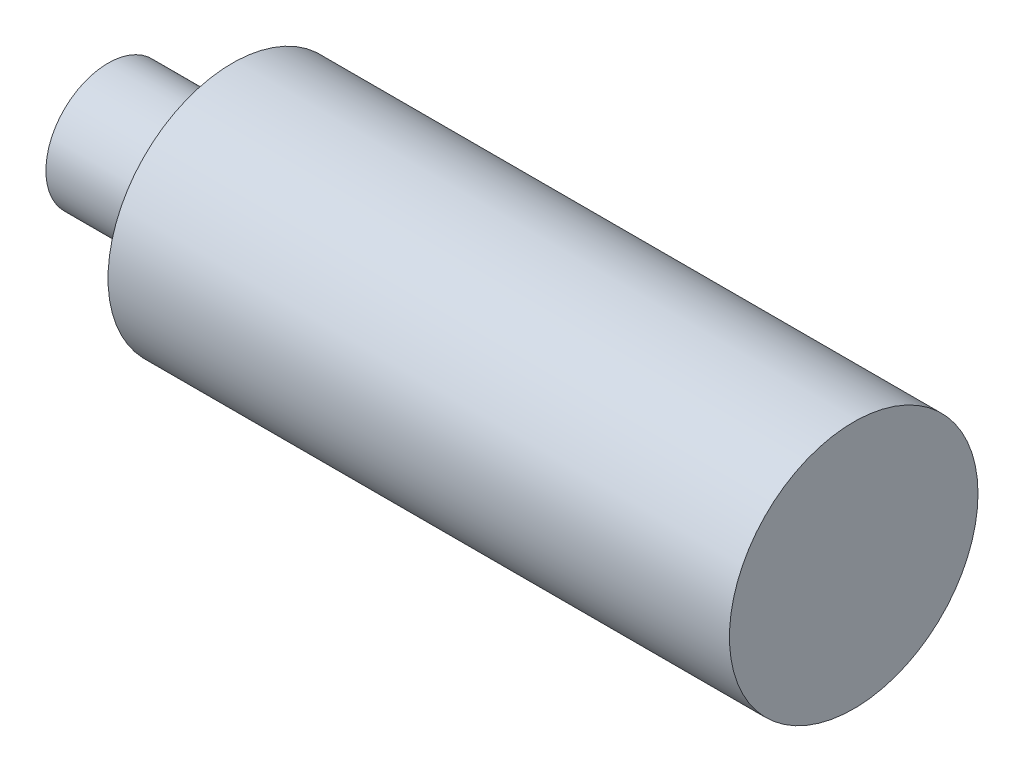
ISO-10303-21;
HEADER;
FILE_DESCRIPTION(('STEP AP214'),'2;1');
FILE_NAME('part.step','',(''),(''),'','','');
FILE_SCHEMA(('AUTOMOTIVE_DESIGN { 1 0 10303 214 1 1 1 1 }'));
ENDSEC;
DATA;
#1=APPLICATION_CONTEXT('core data for automotive mechanical design processes');
#2=APPLICATION_PROTOCOL_DEFINITION('international standard','automotive_design',2000,#1);
#3=PRODUCT_CONTEXT('',#1,'mechanical');
#4=PRODUCT('Part','Part','',(#3));
#5=PRODUCT_RELATED_PRODUCT_CATEGORY('part','',(#4));
#6=PRODUCT_DEFINITION_FORMATION('','',#4);
#7=PRODUCT_DEFINITION_CONTEXT('part definition',#1,'design');
#8=PRODUCT_DEFINITION('design','',#6,#7);
#9=PRODUCT_DEFINITION_SHAPE('','',#8);
#10=(LENGTH_UNIT() NAMED_UNIT(*) SI_UNIT(.MILLI.,.METRE.));
#11=(NAMED_UNIT(*) PLANE_ANGLE_UNIT() SI_UNIT($,.RADIAN.));
#12=(NAMED_UNIT(*) SI_UNIT($,.STERADIAN.) SOLID_ANGLE_UNIT());
#13=UNCERTAINTY_MEASURE_WITH_UNIT(LENGTH_MEASURE(1.E-05),#10,'distance_accuracy_value','');
#14=(GEOMETRIC_REPRESENTATION_CONTEXT(3) GLOBAL_UNCERTAINTY_ASSIGNED_CONTEXT((#13)) GLOBAL_UNIT_ASSIGNED_CONTEXT((#10,
#11,#12)) REPRESENTATION_CONTEXT('',''));
#15=CARTESIAN_POINT('',(0.,0.,0.));
#16=DIRECTION('',(0.,0.,1.));
#17=DIRECTION('',(1.,0.,0.));
#18=AXIS2_PLACEMENT_3D('',#15,#16,#17);
#19=CARTESIAN_POINT('',(2.,0.,0.));
#20=DIRECTION('',(-1.,0.,0.));
#21=DIRECTION('',(0.,0.,1.));
#22=AXIS2_PLACEMENT_3D('',#19,#20,#21);
#23=CYLINDRICAL_SURFACE('',#22,1.);
#24=CARTESIAN_POINT('',(2.,0.,0.));
#25=DIRECTION('',(1.,0.,0.));
#26=DIRECTION('',(0.,0.,-1.));
#27=AXIS2_PLACEMENT_3D('',#24,#25,#26);
#28=CIRCLE('',#27,1.);
#29=CARTESIAN_POINT('',(2.,0.,-1.));
#30=VERTEX_POINT('',#29);
#31=EDGE_CURVE('E10',#30,#30,#28,.T.);
#32=ORIENTED_EDGE('',*,*,#31,.F.);
#33=EDGE_LOOP('',(#32));
#34=FACE_BOUND('',#33,.T.);
#35=CARTESIAN_POINT('',(0.,0.,0.));
#36=DIRECTION('',(1.,0.,0.));
#37=DIRECTION('',(0.,0.,-1.));
#38=AXIS2_PLACEMENT_3D('',#35,#36,#37);
#39=CIRCLE('',#38,1.);
#40=CARTESIAN_POINT('',(0.,0.,-1.));
#41=VERTEX_POINT('',#40);
#42=EDGE_CURVE('E36',#41,#41,#39,.T.);
#43=ORIENTED_EDGE('',*,*,#42,.T.);
#44=EDGE_LOOP('',(#43));
#45=FACE_BOUND('',#44,.T.);
#46=ADVANCED_FACE('F33',(#34,#45),#23,.T.);
#47=CARTESIAN_POINT('',(0.,0.,0.));
#48=DIRECTION('',(1.,0.,0.));
#49=DIRECTION('',(0.,0.,-1.));
#50=AXIS2_PLACEMENT_3D('',#47,#48,#49);
#51=PLANE('',#50);
#52=ORIENTED_EDGE('',*,*,#42,.F.);
#53=EDGE_LOOP('',(#52));
#54=FACE_BOUND('',#53,.T.);
#55=ADVANCED_FACE('F61',(#54),#51,.F.);
#56=CARTESIAN_POINT('',(2.,0.,0.));
#57=DIRECTION('',(1.,0.,0.));
#58=DIRECTION('',(0.,0.,-1.));
#59=AXIS2_PLACEMENT_3D('',#56,#57,#58);
#60=PLANE('',#59);
#61=CARTESIAN_POINT('',(2.,0.,0.));
#62=DIRECTION('',(1.,0.,0.));
#63=DIRECTION('',(0.,0.,-1.));
#64=AXIS2_PLACEMENT_3D('',#61,#62,#63);
#65=CIRCLE('',#64,2.);
#66=CARTESIAN_POINT('',(2.,0.,-2.));
#67=VERTEX_POINT('',#66);
#68=EDGE_CURVE('E45',#67,#67,#65,.T.);
#69=ORIENTED_EDGE('',*,*,#68,.F.);
#70=EDGE_LOOP('',(#69));
#71=FACE_BOUND('',#70,.T.);
#72=ORIENTED_EDGE('',*,*,#31,.T.);
#73=EDGE_LOOP('',(#72));
#74=FACE_BOUND('',#73,.T.);
#75=ADVANCED_FACE('F56',(#71,#74),#60,.F.);
#76=CARTESIAN_POINT('',(12.,0.,0.));
#77=DIRECTION('',(-1.,0.,0.));
#78=DIRECTION('',(0.,0.,1.));
#79=AXIS2_PLACEMENT_3D('',#76,#77,#78);
#80=CYLINDRICAL_SURFACE('',#79,2.);
#81=CARTESIAN_POINT('',(12.,0.,0.));
#82=DIRECTION('',(1.,0.,0.));
#83=DIRECTION('',(0.,0.,-1.));
#84=AXIS2_PLACEMENT_3D('',#81,#82,#83);
#85=CIRCLE('',#84,2.);
#86=CARTESIAN_POINT('',(12.,0.,-2.));
#87=VERTEX_POINT('',#86);
#88=EDGE_CURVE('E43',#87,#87,#85,.T.);
#89=ORIENTED_EDGE('',*,*,#88,.F.);
#90=EDGE_LOOP('',(#89));
#91=FACE_BOUND('',#90,.T.);
#92=ORIENTED_EDGE('',*,*,#68,.T.);
#93=EDGE_LOOP('',(#92));
#94=FACE_BOUND('',#93,.T.);
#95=ADVANCED_FACE('F53',(#91,#94),#80,.T.);
#96=CARTESIAN_POINT('',(12.,0.,0.));
#97=DIRECTION('',(1.,0.,0.));
#98=DIRECTION('',(0.,0.,-1.));
#99=AXIS2_PLACEMENT_3D('',#96,#97,#98);
#100=PLANE('',#99);
#101=ORIENTED_EDGE('',*,*,#88,.T.);
#102=EDGE_LOOP('',(#101));
#103=FACE_BOUND('',#102,.T.);
#104=ADVANCED_FACE('F51',(#103),#100,.T.);
#105=CLOSED_SHELL('',(#46,#55,#75,#95,#104));
#106=MANIFOLD_SOLID_BREP('B2',#105);
#107=ADVANCED_BREP_SHAPE_REPRESENTATION('',(#18,#106),#14);
#108=SHAPE_DEFINITION_REPRESENTATION(#9,#107);
ENDSEC;
END-ISO-10303-21;
